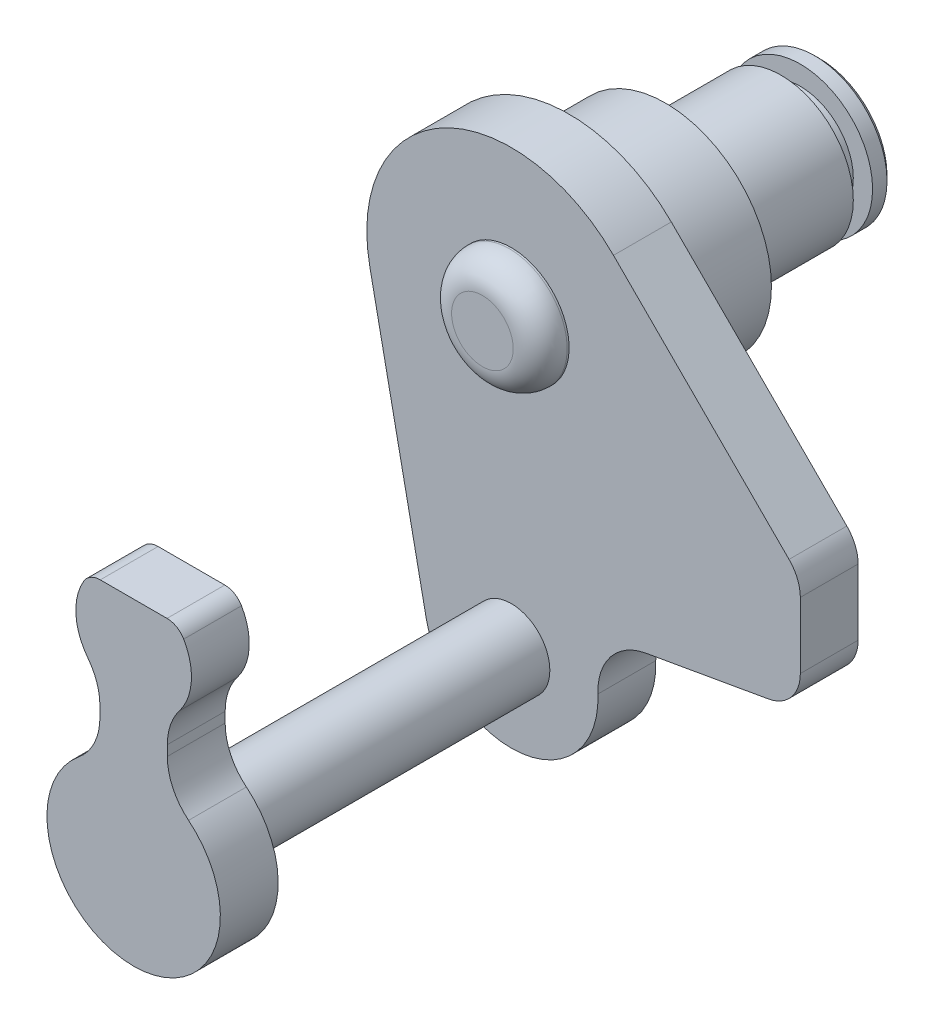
ISO-10303-21;
HEADER;
FILE_DESCRIPTION(('STEP AP214'),'2;1');
FILE_NAME('part.step','',(''),(''),'','','');
FILE_SCHEMA(('AUTOMOTIVE_DESIGN { 1 0 10303 214 1 1 1 1 }'));
ENDSEC;
DATA;
#1=APPLICATION_CONTEXT('core data for automotive mechanical design processes');
#2=APPLICATION_PROTOCOL_DEFINITION('international standard','automotive_design',2000,#1);
#3=PRODUCT_CONTEXT('',#1,'mechanical');
#4=PRODUCT('Part','Part','',(#3));
#5=PRODUCT_RELATED_PRODUCT_CATEGORY('part','',(#4));
#6=PRODUCT_DEFINITION_FORMATION('','',#4);
#7=PRODUCT_DEFINITION_CONTEXT('part definition',#1,'design');
#8=PRODUCT_DEFINITION('design','',#6,#7);
#9=PRODUCT_DEFINITION_SHAPE('','',#8);
#10=(LENGTH_UNIT() NAMED_UNIT(*) SI_UNIT(.MILLI.,.METRE.));
#11=(NAMED_UNIT(*) PLANE_ANGLE_UNIT() SI_UNIT($,.RADIAN.));
#12=(NAMED_UNIT(*) SI_UNIT($,.STERADIAN.) SOLID_ANGLE_UNIT());
#13=UNCERTAINTY_MEASURE_WITH_UNIT(LENGTH_MEASURE(1.E-05),#10,'distance_accuracy_value','');
#14=(GEOMETRIC_REPRESENTATION_CONTEXT(3) GLOBAL_UNCERTAINTY_ASSIGNED_CONTEXT((#13)) GLOBAL_UNIT_ASSIGNED_CONTEXT((#10,
#11,#12)) REPRESENTATION_CONTEXT('',''));
#15=CARTESIAN_POINT('',(0.,0.,0.));
#16=DIRECTION('',(0.,0.,1.));
#17=DIRECTION('',(1.,0.,0.));
#18=AXIS2_PLACEMENT_3D('',#15,#16,#17);
#19=CARTESIAN_POINT('',(0.,0.,-19.6));
#20=DIRECTION('',(0.,0.,-1.));
#21=DIRECTION('',(-1.,0.,0.));
#22=AXIS2_PLACEMENT_3D('',#19,#20,#21);
#23=PLANE('',#22);
#24=DIRECTION('',(0.,-1.,0.));
#25=VECTOR('',#24,1.);
#26=CARTESIAN_POINT('',(15.,4.67575793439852,-19.6));
#27=LINE('',#26,#25);
#28=CARTESIAN_POINT('',(15.,9.77817459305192,-19.6));
#29=VERTEX_POINT('',#28);
#30=CARTESIAN_POINT('',(15.,6.35395719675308,-19.6));
#31=VERTEX_POINT('',#30);
#32=EDGE_CURVE('E263',#29,#31,#27,.T.);
#33=ORIENTED_EDGE('',*,*,#32,.T.);
#34=CARTESIAN_POINT('',(13.,6.35395719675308,-19.6));
#35=DIRECTION('',(0.,0.,-1.));
#36=DIRECTION('',(-1.,0.,0.));
#37=AXIS2_PLACEMENT_3D('',#34,#35,#36);
#38=CIRCLE('',#37,2.);
#39=CARTESIAN_POINT('',(13.3472963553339,4.38434169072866,-19.6));
#40=VERTEX_POINT('',#39);
#41=EDGE_CURVE('E398',#31,#40,#38,.T.);
#42=ORIENTED_EDGE('',*,*,#41,.T.);
#43=DIRECTION('',(-0.984807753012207,-0.173648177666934,0.));
#44=VECTOR('',#43,1.);
#45=CARTESIAN_POINT('',(15.,4.67575793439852,-19.6));
#46=LINE('',#45,#44);
#47=CARTESIAN_POINT('',(6.972813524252,3.26034837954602,-19.6));
#48=VERTEX_POINT('',#47);
#49=EDGE_CURVE('E266',#40,#48,#46,.T.);
#50=ORIENTED_EDGE('',*,*,#49,.T.);
#51=CARTESIAN_POINT('',(7.4937580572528,0.305925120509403,-19.6));
#52=DIRECTION('',(0.,0.,-1.));
#53=DIRECTION('',(-1.,0.,0.));
#54=AXIS2_PLACEMENT_3D('',#51,#52,#53);
#55=CIRCLE('',#54,3.);
#56=CARTESIAN_POINT('',(4.49625483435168,0.183555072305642,-19.6));
#57=VERTEX_POINT('',#56);
#58=EDGE_CURVE('E382',#48,#57,#55,.F.);
#59=ORIENTED_EDGE('',*,*,#58,.T.);
#60=CARTESIAN_POINT('',(0.,0.,-19.6));
#61=DIRECTION('',(0.,0.,-1.));
#62=DIRECTION('',(-1.,0.,0.));
#63=AXIS2_PLACEMENT_3D('',#60,#61,#62);
#64=CIRCLE('',#63,4.5);
#65=CARTESIAN_POINT('',(-4.40908153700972,-0.9,-19.6));
#66=VERTEX_POINT('',#65);
#67=EDGE_CURVE('E255',#57,#66,#64,.T.);
#68=ORIENTED_EDGE('',*,*,#67,.T.);
#69=DIRECTION('',(-0.2,0.979795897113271,0.));
#70=VECTOR('',#69,1.);
#71=CARTESIAN_POINT('',(-7.34846922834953,13.5,-19.6));
#72=LINE('',#71,#70);
#73=CARTESIAN_POINT('',(-7.34846922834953,13.5,-19.6));
#74=VERTEX_POINT('',#73);
#75=EDGE_CURVE('E257',#66,#74,#72,.T.);
#76=ORIENTED_EDGE('',*,*,#75,.T.);
#77=CARTESIAN_POINT('',(0.,15.,-19.6));
#78=DIRECTION('',(0.,0.,-1.));
#79=DIRECTION('',(-1.,0.,0.));
#80=AXIS2_PLACEMENT_3D('',#77,#78,#79);
#81=CIRCLE('',#80,7.5);
#82=CARTESIAN_POINT('',(5.30330085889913,20.3033008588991,-19.6));
#83=VERTEX_POINT('',#82);
#84=EDGE_CURVE('E259',#74,#83,#81,.T.);
#85=ORIENTED_EDGE('',*,*,#84,.T.);
#86=DIRECTION('',(0.707106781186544,-0.707106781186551,0.));
#87=VECTOR('',#86,1.);
#88=CARTESIAN_POINT('',(5.30330085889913,20.3033008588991,-19.6));
#89=LINE('',#88,#87);
#90=CARTESIAN_POINT('',(14.4142135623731,11.192388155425,-19.6));
#91=VERTEX_POINT('',#90);
#92=EDGE_CURVE('E261',#83,#91,#89,.T.);
#93=ORIENTED_EDGE('',*,*,#92,.T.);
#94=CARTESIAN_POINT('',(13.,9.77817459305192,-19.6));
#95=DIRECTION('',(0.,0.,-1.));
#96=DIRECTION('',(-1.,0.,0.));
#97=AXIS2_PLACEMENT_3D('',#94,#95,#96);
#98=CIRCLE('',#97,2.);
#99=EDGE_CURVE('E396',#91,#29,#98,.T.);
#100=ORIENTED_EDGE('',*,*,#99,.T.);
#101=EDGE_LOOP('',(#33,#42,#50,#59,#68,#76,#85,#93,#100));
#102=FACE_BOUND('',#101,.T.);
#103=DIRECTION('',(-1.,0.,0.));
#104=VECTOR('',#103,1.);
#105=CARTESIAN_POINT('',(1.6583123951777,-2.5,-19.6));
#106=LINE('',#105,#104);
#107=CARTESIAN_POINT('',(1.6583123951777,-2.5,-19.6));
#108=VERTEX_POINT('',#107);
#109=CARTESIAN_POINT('',(-1.6583123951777,-2.5,-19.6));
#110=VERTEX_POINT('',#109);
#111=EDGE_CURVE('E205',#108,#110,#106,.T.);
#112=ORIENTED_EDGE('',*,*,#111,.F.);
#113=CARTESIAN_POINT('',(0.,0.,-19.6));
#114=DIRECTION('',(0.,0.,-1.));
#115=DIRECTION('',(-1.,0.,0.));
#116=AXIS2_PLACEMENT_3D('',#113,#114,#115);
#117=CIRCLE('',#116,3.);
#118=CARTESIAN_POINT('',(1.6583123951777,2.5,-19.6));
#119=VERTEX_POINT('',#118);
#120=EDGE_CURVE('E216',#119,#108,#117,.T.);
#121=ORIENTED_EDGE('',*,*,#120,.F.);
#122=DIRECTION('',(1.,0.,0.));
#123=VECTOR('',#122,1.);
#124=CARTESIAN_POINT('',(1.6583123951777,2.5,-19.6));
#125=LINE('',#124,#123);
#126=CARTESIAN_POINT('',(-1.6583123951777,2.5,-19.6));
#127=VERTEX_POINT('',#126);
#128=EDGE_CURVE('E228',#127,#119,#125,.T.);
#129=ORIENTED_EDGE('',*,*,#128,.F.);
#130=CARTESIAN_POINT('',(0.,0.,-19.6));
#131=DIRECTION('',(0.,0.,-1.));
#132=DIRECTION('',(-1.,0.,0.));
#133=AXIS2_PLACEMENT_3D('',#130,#131,#132);
#134=CIRCLE('',#133,3.);
#135=EDGE_CURVE('E226',#110,#127,#134,.T.);
#136=ORIENTED_EDGE('',*,*,#135,.F.);
#137=EDGE_LOOP('',(#112,#121,#129,#136));
#138=FACE_BOUND('',#137,.T.);
#139=CARTESIAN_POINT('',(0.,15.,-19.6));
#140=DIRECTION('',(0.,0.,1.));
#141=DIRECTION('',(1.,0.,0.));
#142=AXIS2_PLACEMENT_3D('',#139,#140,#141);
#143=CIRCLE('',#142,5.5);
#144=CARTESIAN_POINT('',(5.5,15.,-19.6));
#145=VERTEX_POINT('',#144);
#146=EDGE_CURVE('E222',#145,#145,#143,.T.);
#147=ORIENTED_EDGE('',*,*,#146,.T.);
#148=EDGE_LOOP('',(#147));
#149=FACE_BOUND('',#148,.T.);
#150=ADVANCED_FACE('F31',(#102,#138,#149),#23,.T.);
#151=CARTESIAN_POINT('',(0.,0.,-16.6));
#152=DIRECTION('',(0.,0.,-1.));
#153=DIRECTION('',(-1.,0.,0.));
#154=AXIS2_PLACEMENT_3D('',#151,#152,#153);
#155=PLANE('',#154);
#156=CARTESIAN_POINT('',(0.,0.,-16.6));
#157=DIRECTION('',(0.,0.,-1.));
#158=DIRECTION('',(-1.,0.,0.));
#159=AXIS2_PLACEMENT_3D('',#156,#157,#158);
#160=CIRCLE('',#159,2.);
#161=CARTESIAN_POINT('',(2.,0.,-16.6));
#162=VERTEX_POINT('',#161);
#163=EDGE_CURVE('E277',#162,#162,#160,.T.);
#164=ORIENTED_EDGE('',*,*,#163,.T.);
#165=EDGE_LOOP('',(#164));
#166=FACE_BOUND('',#165,.T.);
#167=DIRECTION('',(-0.984807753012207,-0.173648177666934,0.));
#168=VECTOR('',#167,1.);
#169=CARTESIAN_POINT('',(15.,4.67575793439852,-16.6));
#170=LINE('',#169,#168);
#171=CARTESIAN_POINT('',(13.3472963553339,4.38434169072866,-16.6));
#172=VERTEX_POINT('',#171);
#173=CARTESIAN_POINT('',(6.972813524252,3.26034837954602,-16.6));
#174=VERTEX_POINT('',#173);
#175=EDGE_CURVE('E253',#172,#174,#170,.T.);
#176=ORIENTED_EDGE('',*,*,#175,.F.);
#177=CARTESIAN_POINT('',(13.,6.35395719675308,-16.6));
#178=DIRECTION('',(0.,0.,-1.));
#179=DIRECTION('',(-1.,0.,0.));
#180=AXIS2_PLACEMENT_3D('',#177,#178,#179);
#181=CIRCLE('',#180,2.);
#182=CARTESIAN_POINT('',(15.,6.35395719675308,-16.6));
#183=VERTEX_POINT('',#182);
#184=EDGE_CURVE('E389',#172,#183,#181,.F.);
#185=ORIENTED_EDGE('',*,*,#184,.T.);
#186=DIRECTION('',(0.,-1.,0.));
#187=VECTOR('',#186,1.);
#188=CARTESIAN_POINT('',(15.,4.67575793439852,-16.6));
#189=LINE('',#188,#187);
#190=CARTESIAN_POINT('',(15.,9.77817459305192,-16.6));
#191=VERTEX_POINT('',#190);
#192=EDGE_CURVE('E250',#191,#183,#189,.T.);
#193=ORIENTED_EDGE('',*,*,#192,.F.);
#194=CARTESIAN_POINT('',(13.,9.77817459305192,-16.6));
#195=DIRECTION('',(0.,0.,-1.));
#196=DIRECTION('',(-1.,0.,0.));
#197=AXIS2_PLACEMENT_3D('',#194,#195,#196);
#198=CIRCLE('',#197,2.);
#199=CARTESIAN_POINT('',(14.4142135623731,11.192388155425,-16.6));
#200=VERTEX_POINT('',#199);
#201=EDGE_CURVE('E387',#191,#200,#198,.F.);
#202=ORIENTED_EDGE('',*,*,#201,.T.);
#203=DIRECTION('',(0.707106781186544,-0.707106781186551,0.));
#204=VECTOR('',#203,1.);
#205=CARTESIAN_POINT('',(5.30330085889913,20.3033008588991,-16.6));
#206=LINE('',#205,#204);
#207=CARTESIAN_POINT('',(5.30330085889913,20.3033008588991,-16.6));
#208=VERTEX_POINT('',#207);
#209=EDGE_CURVE('E248',#208,#200,#206,.T.);
#210=ORIENTED_EDGE('',*,*,#209,.F.);
#211=CARTESIAN_POINT('',(0.,15.,-16.6));
#212=DIRECTION('',(0.,0.,-1.));
#213=DIRECTION('',(-1.,0.,0.));
#214=AXIS2_PLACEMENT_3D('',#211,#212,#213);
#215=CIRCLE('',#214,7.5);
#216=CARTESIAN_POINT('',(-7.34846922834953,13.5,-16.6));
#217=VERTEX_POINT('',#216);
#218=EDGE_CURVE('E246',#217,#208,#215,.T.);
#219=ORIENTED_EDGE('',*,*,#218,.F.);
#220=DIRECTION('',(-0.2,0.979795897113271,0.));
#221=VECTOR('',#220,1.);
#222=CARTESIAN_POINT('',(-7.34846922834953,13.5,-16.6));
#223=LINE('',#222,#221);
#224=CARTESIAN_POINT('',(-4.40908153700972,-0.9,-16.6));
#225=VERTEX_POINT('',#224);
#226=EDGE_CURVE('E244',#225,#217,#223,.T.);
#227=ORIENTED_EDGE('',*,*,#226,.F.);
#228=CARTESIAN_POINT('',(0.,0.,-16.6));
#229=DIRECTION('',(0.,0.,-1.));
#230=DIRECTION('',(-1.,0.,0.));
#231=AXIS2_PLACEMENT_3D('',#228,#229,#230);
#232=CIRCLE('',#231,4.5);
#233=CARTESIAN_POINT('',(4.49625483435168,0.183555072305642,-16.6));
#234=VERTEX_POINT('',#233);
#235=EDGE_CURVE('E211',#234,#225,#232,.T.);
#236=ORIENTED_EDGE('',*,*,#235,.F.);
#237=CARTESIAN_POINT('',(7.4937580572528,0.305925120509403,-16.6));
#238=DIRECTION('',(0.,0.,-1.));
#239=DIRECTION('',(-1.,0.,0.));
#240=AXIS2_PLACEMENT_3D('',#237,#238,#239);
#241=CIRCLE('',#240,3.);
#242=EDGE_CURVE('E379',#234,#174,#241,.T.);
#243=ORIENTED_EDGE('',*,*,#242,.T.);
#244=EDGE_LOOP('',(#176,#185,#193,#202,#210,#219,#227,#236,#243));
#245=FACE_BOUND('',#244,.T.);
#246=CARTESIAN_POINT('',(0.,15.,-16.6));
#247=DIRECTION('',(0.,0.,-1.));
#248=DIRECTION('',(-1.,0.,0.));
#249=AXIS2_PLACEMENT_3D('',#246,#247,#248);
#250=CIRCLE('',#249,3.);
#251=CARTESIAN_POINT('',(-3.,15.,-16.6));
#252=VERTEX_POINT('',#251);
#253=EDGE_CURVE('E401',#252,#252,#250,.F.);
#254=ORIENTED_EDGE('',*,*,#253,.F.);
#255=EDGE_LOOP('',(#254));
#256=FACE_BOUND('',#255,.T.);
#257=ADVANCED_FACE('F428',(#166,#245,#256),#155,.F.);
#258=CARTESIAN_POINT('',(0.,10.,0.));
#259=DIRECTION('',(0.,0.,1.));
#260=DIRECTION('',(1.,0.,0.));
#261=AXIS2_PLACEMENT_3D('',#258,#259,#260);
#262=PLANE('',#261);
#263=CARTESIAN_POINT('',(0.,10.,0.));
#264=DIRECTION('',(0.,0.,1.));
#265=DIRECTION('',(1.,0.,0.));
#266=AXIS2_PLACEMENT_3D('',#263,#264,#265);
#267=CIRCLE('',#266,3.);
#268=CARTESIAN_POINT('',(-2.59807621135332,11.5,0.));
#269=VERTEX_POINT('',#268);
#270=CARTESIAN_POINT('',(-2.375,8.1671402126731,0.));
#271=VERTEX_POINT('',#270);
#272=EDGE_CURVE('E285',#269,#271,#267,.T.);
#273=ORIENTED_EDGE('',*,*,#272,.F.);
#274=CARTESIAN_POINT('',(-1.73205080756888,11.,0.));
#275=DIRECTION('',(0.,0.,1.));
#276=DIRECTION('',(1.,0.,0.));
#277=AXIS2_PLACEMENT_3D('',#274,#275,#276);
#278=CIRCLE('',#277,1.);
#279=CARTESIAN_POINT('',(-1.73205080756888,12.,0.));
#280=VERTEX_POINT('',#279);
#281=EDGE_CURVE('E320',#269,#280,#278,.F.);
#282=ORIENTED_EDGE('',*,*,#281,.T.);
#283=DIRECTION('',(-1.,0.,0.));
#284=VECTOR('',#283,1.);
#285=CARTESIAN_POINT('',(-2.23606797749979,12.,0.));
#286=LINE('',#285,#284);
#287=CARTESIAN_POINT('',(1.73205080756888,12.,0.));
#288=VERTEX_POINT('',#287);
#289=EDGE_CURVE('E282',#288,#280,#286,.T.);
#290=ORIENTED_EDGE('',*,*,#289,.F.);
#291=CARTESIAN_POINT('',(1.73205080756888,11.,0.));
#292=DIRECTION('',(0.,0.,1.));
#293=DIRECTION('',(1.,0.,0.));
#294=AXIS2_PLACEMENT_3D('',#291,#292,#293);
#295=CIRCLE('',#294,1.);
#296=CARTESIAN_POINT('',(2.59807621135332,11.5,0.));
#297=VERTEX_POINT('',#296);
#298=EDGE_CURVE('E317',#288,#297,#295,.F.);
#299=ORIENTED_EDGE('',*,*,#298,.T.);
#300=CARTESIAN_POINT('',(0.,10.,0.));
#301=DIRECTION('',(0.,0.,1.));
#302=DIRECTION('',(1.,0.,0.));
#303=AXIS2_PLACEMENT_3D('',#300,#301,#302);
#304=CIRCLE('',#303,3.);
#305=CARTESIAN_POINT('',(2.375,8.1671402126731,0.));
#306=VERTEX_POINT('',#305);
#307=EDGE_CURVE('E280',#306,#297,#304,.T.);
#308=ORIENTED_EDGE('',*,*,#307,.F.);
#309=CARTESIAN_POINT('',(4.75,6.33428042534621,0.));
#310=DIRECTION('',(0.,0.,1.));
#311=DIRECTION('',(1.,0.,0.));
#312=AXIS2_PLACEMENT_3D('',#309,#310,#311);
#313=CIRCLE('',#312,3.);
#314=CARTESIAN_POINT('',(1.75,6.33428042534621,0.));
#315=VERTEX_POINT('',#314);
#316=EDGE_CURVE('E354',#306,#315,#313,.T.);
#317=ORIENTED_EDGE('',*,*,#316,.T.);
#318=DIRECTION('',(0.,1.,0.));
#319=VECTOR('',#318,1.);
#320=CARTESIAN_POINT('',(1.75,4.14578098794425,0.));
#321=LINE('',#320,#319);
#322=CARTESIAN_POINT('',(1.75,5.80409338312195,0.));
#323=VERTEX_POINT('',#322);
#324=EDGE_CURVE('E294',#323,#315,#321,.T.);
#325=ORIENTED_EDGE('',*,*,#324,.F.);
#326=CARTESIAN_POINT('',(4.75,5.80409338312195,0.));
#327=DIRECTION('',(0.,0.,1.));
#328=DIRECTION('',(1.,0.,0.));
#329=AXIS2_PLACEMENT_3D('',#326,#327,#328);
#330=CIRCLE('',#329,3.);
#331=CARTESIAN_POINT('',(2.85,3.48245602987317,0.));
#332=VERTEX_POINT('',#331);
#333=EDGE_CURVE('E358',#323,#332,#330,.T.);
#334=ORIENTED_EDGE('',*,*,#333,.T.);
#335=CARTESIAN_POINT('',(0.,0.,0.));
#336=DIRECTION('',(0.,0.,1.));
#337=DIRECTION('',(1.,0.,0.));
#338=AXIS2_PLACEMENT_3D('',#335,#336,#337);
#339=CIRCLE('',#338,4.5);
#340=CARTESIAN_POINT('',(-2.85,3.48245602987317,0.));
#341=VERTEX_POINT('',#340);
#342=EDGE_CURVE('E291',#341,#332,#339,.T.);
#343=ORIENTED_EDGE('',*,*,#342,.F.);
#344=CARTESIAN_POINT('',(-4.75,5.80409338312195,0.));
#345=DIRECTION('',(0.,0.,1.));
#346=DIRECTION('',(1.,0.,0.));
#347=AXIS2_PLACEMENT_3D('',#344,#345,#346);
#348=CIRCLE('',#347,3.);
#349=CARTESIAN_POINT('',(-1.75,5.80409338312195,0.));
#350=VERTEX_POINT('',#349);
#351=EDGE_CURVE('E362',#341,#350,#348,.T.);
#352=ORIENTED_EDGE('',*,*,#351,.T.);
#353=DIRECTION('',(0.,-1.,0.));
#354=VECTOR('',#353,1.);
#355=CARTESIAN_POINT('',(-1.75,4.14578098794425,0.));
#356=LINE('',#355,#354);
#357=CARTESIAN_POINT('',(-1.75,6.33428042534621,0.));
#358=VERTEX_POINT('',#357);
#359=EDGE_CURVE('E288',#358,#350,#356,.T.);
#360=ORIENTED_EDGE('',*,*,#359,.F.);
#361=CARTESIAN_POINT('',(-4.75,6.3342804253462,0.));
#362=DIRECTION('',(0.,0.,1.));
#363=DIRECTION('',(1.,0.,0.));
#364=AXIS2_PLACEMENT_3D('',#361,#362,#363);
#365=CIRCLE('',#364,3.);
#366=EDGE_CURVE('E366',#358,#271,#365,.T.);
#367=ORIENTED_EDGE('',*,*,#366,.T.);
#368=EDGE_LOOP('',(#273,#282,#290,#299,#308,#317,#325,#334,#343,#352,#360,#367));
#369=FACE_BOUND('',#368,.T.);
#370=CARTESIAN_POINT('',(0.,0.,0.));
#371=DIRECTION('',(0.,0.,1.));
#372=DIRECTION('',(1.,0.,0.));
#373=AXIS2_PLACEMENT_3D('',#370,#371,#372);
#374=CIRCLE('',#373,2.);
#375=CARTESIAN_POINT('',(2.,0.,0.));
#376=VERTEX_POINT('',#375);
#377=EDGE_CURVE('E370',#376,#376,#374,.F.);
#378=ORIENTED_EDGE('',*,*,#377,.F.);
#379=EDGE_LOOP('',(#378));
#380=FACE_BOUND('',#379,.T.);
#381=ADVANCED_FACE('F434',(#369,#380),#262,.F.);
#382=CARTESIAN_POINT('',(0.,10.,3.));
#383=DIRECTION('',(0.,0.,-1.));
#384=DIRECTION('',(-1.,0.,0.));
#385=AXIS2_PLACEMENT_3D('',#382,#383,#384);
#386=CYLINDRICAL_SURFACE('',#385,3.);
#387=CARTESIAN_POINT('',(0.,10.,3.));
#388=DIRECTION('',(0.,0.,1.));
#389=DIRECTION('',(1.,0.,0.));
#390=AXIS2_PLACEMENT_3D('',#387,#388,#389);
#391=CIRCLE('',#390,3.);
#392=CARTESIAN_POINT('',(2.375,8.1671402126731,3.));
#393=VERTEX_POINT('',#392);
#394=CARTESIAN_POINT('',(2.59807621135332,11.5,3.));
#395=VERTEX_POINT('',#394);
#396=EDGE_CURVE('E297',#393,#395,#391,.T.);
#397=ORIENTED_EDGE('',*,*,#396,.F.);
#398=DIRECTION('',(0.,0.,-1.));
#399=VECTOR('',#398,1.);
#400=CARTESIAN_POINT('',(2.375,8.1671402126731,3.));
#401=LINE('',#400,#399);
#402=EDGE_CURVE('E334',#393,#306,#401,.T.);
#403=ORIENTED_EDGE('',*,*,#402,.T.);
#404=ORIENTED_EDGE('',*,*,#307,.T.);
#405=DIRECTION('',(0.,0.,-1.));
#406=VECTOR('',#405,1.);
#407=CARTESIAN_POINT('',(2.59807621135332,11.5,3.));
#408=LINE('',#407,#406);
#409=EDGE_CURVE('E331',#297,#395,#408,.F.);
#410=ORIENTED_EDGE('',*,*,#409,.T.);
#411=EDGE_LOOP('',(#397,#403,#404,#410));
#412=FACE_BOUND('',#411,.T.);
#413=ADVANCED_FACE('F33',(#412),#386,.T.);
#414=CARTESIAN_POINT('',(-2.23606797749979,12.,3.));
#415=DIRECTION('',(0.,-1.,0.));
#416=DIRECTION('',(0.,0.,-1.));
#417=AXIS2_PLACEMENT_3D('',#414,#415,#416);
#418=PLANE('',#417);
#419=ORIENTED_EDGE('',*,*,#289,.T.);
#420=DIRECTION('',(0.,0.,-1.));
#421=VECTOR('',#420,1.);
#422=CARTESIAN_POINT('',(-1.73205080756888,12.,3.));
#423=LINE('',#422,#421);
#424=CARTESIAN_POINT('',(-1.73205080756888,12.,3.));
#425=VERTEX_POINT('',#424);
#426=EDGE_CURVE('E325',#280,#425,#423,.F.);
#427=ORIENTED_EDGE('',*,*,#426,.T.);
#428=DIRECTION('',(-1.,0.,0.));
#429=VECTOR('',#428,1.);
#430=CARTESIAN_POINT('',(-2.23606797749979,12.,3.));
#431=LINE('',#430,#429);
#432=CARTESIAN_POINT('',(1.73205080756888,12.,3.));
#433=VERTEX_POINT('',#432);
#434=EDGE_CURVE('E299',#433,#425,#431,.T.);
#435=ORIENTED_EDGE('',*,*,#434,.F.);
#436=DIRECTION('',(0.,0.,-1.));
#437=VECTOR('',#436,1.);
#438=CARTESIAN_POINT('',(1.73205080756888,12.,3.));
#439=LINE('',#438,#437);
#440=EDGE_CURVE('E322',#433,#288,#439,.T.);
#441=ORIENTED_EDGE('',*,*,#440,.T.);
#442=EDGE_LOOP('',(#419,#427,#435,#441));
#443=FACE_BOUND('',#442,.T.);
#444=ADVANCED_FACE('F512',(#443),#418,.F.);
#445=CARTESIAN_POINT('',(0.,10.,3.));
#446=DIRECTION('',(0.,0.,-1.));
#447=DIRECTION('',(-1.,0.,0.));
#448=AXIS2_PLACEMENT_3D('',#445,#446,#447);
#449=CYLINDRICAL_SURFACE('',#448,3.);
#450=ORIENTED_EDGE('',*,*,#272,.T.);
#451=DIRECTION('',(0.,0.,-1.));
#452=VECTOR('',#451,1.);
#453=CARTESIAN_POINT('',(-2.375,8.1671402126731,3.));
#454=LINE('',#453,#452);
#455=CARTESIAN_POINT('',(-2.375,8.1671402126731,3.));
#456=VERTEX_POINT('',#455);
#457=EDGE_CURVE('E352',#271,#456,#454,.F.);
#458=ORIENTED_EDGE('',*,*,#457,.T.);
#459=CARTESIAN_POINT('',(0.,10.,3.));
#460=DIRECTION('',(0.,0.,1.));
#461=DIRECTION('',(1.,0.,0.));
#462=AXIS2_PLACEMENT_3D('',#459,#460,#461);
#463=CIRCLE('',#462,3.);
#464=CARTESIAN_POINT('',(-2.59807621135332,11.5,3.));
#465=VERTEX_POINT('',#464);
#466=EDGE_CURVE('E302',#465,#456,#463,.T.);
#467=ORIENTED_EDGE('',*,*,#466,.F.);
#468=DIRECTION('',(0.,0.,-1.));
#469=VECTOR('',#468,1.);
#470=CARTESIAN_POINT('',(-2.59807621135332,11.5,3.));
#471=LINE('',#470,#469);
#472=EDGE_CURVE('E314',#465,#269,#471,.T.);
#473=ORIENTED_EDGE('',*,*,#472,.T.);
#474=EDGE_LOOP('',(#450,#458,#467,#473));
#475=FACE_BOUND('',#474,.T.);
#476=ADVANCED_FACE('F509',(#475),#449,.T.);
#477=CARTESIAN_POINT('',(-1.75,4.14578098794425,3.));
#478=DIRECTION('',(1.,0.,0.));
#479=DIRECTION('',(0.,1.,0.));
#480=AXIS2_PLACEMENT_3D('',#477,#478,#479);
#481=PLANE('',#480);
#482=ORIENTED_EDGE('',*,*,#359,.T.);
#483=DIRECTION('',(0.,0.,1.));
#484=VECTOR('',#483,1.);
#485=CARTESIAN_POINT('',(-1.75,5.80409338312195,3.));
#486=LINE('',#485,#484);
#487=CARTESIAN_POINT('',(-1.75,5.80409338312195,3.));
#488=VERTEX_POINT('',#487);
#489=EDGE_CURVE('E350',#350,#488,#486,.T.);
#490=ORIENTED_EDGE('',*,*,#489,.T.);
#491=DIRECTION('',(0.,-1.,0.));
#492=VECTOR('',#491,1.);
#493=CARTESIAN_POINT('',(-1.75,4.14578098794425,3.));
#494=LINE('',#493,#492);
#495=CARTESIAN_POINT('',(-1.75,6.33428042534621,3.));
#496=VERTEX_POINT('',#495);
#497=EDGE_CURVE('E305',#496,#488,#494,.T.);
#498=ORIENTED_EDGE('',*,*,#497,.F.);
#499=DIRECTION('',(0.,0.,1.));
#500=VECTOR('',#499,1.);
#501=CARTESIAN_POINT('',(-1.75,6.33428042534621,0.));
#502=LINE('',#501,#500);
#503=EDGE_CURVE('E347',#496,#358,#502,.F.);
#504=ORIENTED_EDGE('',*,*,#503,.T.);
#505=EDGE_LOOP('',(#482,#490,#498,#504));
#506=FACE_BOUND('',#505,.T.);
#507=ADVANCED_FACE('F505',(#506),#481,.F.);
#508=CARTESIAN_POINT('',(0.,0.,3.));
#509=DIRECTION('',(0.,0.,-1.));
#510=DIRECTION('',(-1.,0.,0.));
#511=AXIS2_PLACEMENT_3D('',#508,#509,#510);
#512=CYLINDRICAL_SURFACE('',#511,4.5);
#513=ORIENTED_EDGE('',*,*,#342,.T.);
#514=DIRECTION('',(0.,0.,-1.));
#515=VECTOR('',#514,1.);
#516=CARTESIAN_POINT('',(2.85,3.48245602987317,3.));
#517=LINE('',#516,#515);
#518=CARTESIAN_POINT('',(2.85,3.48245602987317,3.));
#519=VERTEX_POINT('',#518);
#520=EDGE_CURVE('E345',#332,#519,#517,.F.);
#521=ORIENTED_EDGE('',*,*,#520,.T.);
#522=CARTESIAN_POINT('',(0.,0.,3.));
#523=DIRECTION('',(0.,0.,1.));
#524=DIRECTION('',(1.,0.,0.));
#525=AXIS2_PLACEMENT_3D('',#522,#523,#524);
#526=CIRCLE('',#525,4.5);
#527=CARTESIAN_POINT('',(-2.85,3.48245602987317,3.));
#528=VERTEX_POINT('',#527);
#529=EDGE_CURVE('E308',#528,#519,#526,.T.);
#530=ORIENTED_EDGE('',*,*,#529,.F.);
#531=DIRECTION('',(0.,0.,-1.));
#532=VECTOR('',#531,1.);
#533=CARTESIAN_POINT('',(-2.85,3.48245602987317,3.));
#534=LINE('',#533,#532);
#535=EDGE_CURVE('E342',#528,#341,#534,.T.);
#536=ORIENTED_EDGE('',*,*,#535,.T.);
#537=EDGE_LOOP('',(#513,#521,#530,#536));
#538=FACE_BOUND('',#537,.T.);
#539=ADVANCED_FACE('F501',(#538),#512,.T.);
#540=CARTESIAN_POINT('',(1.75,4.14578098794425,3.));
#541=DIRECTION('',(-1.,0.,0.));
#542=DIRECTION('',(0.,0.,1.));
#543=AXIS2_PLACEMENT_3D('',#540,#541,#542);
#544=PLANE('',#543);
#545=ORIENTED_EDGE('',*,*,#324,.T.);
#546=DIRECTION('',(0.,0.,1.));
#547=VECTOR('',#546,1.);
#548=CARTESIAN_POINT('',(1.75,6.33428042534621,3.));
#549=LINE('',#548,#547);
#550=CARTESIAN_POINT('',(1.75,6.33428042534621,3.));
#551=VERTEX_POINT('',#550);
#552=EDGE_CURVE('E340',#315,#551,#549,.T.);
#553=ORIENTED_EDGE('',*,*,#552,.T.);
#554=DIRECTION('',(0.,1.,0.));
#555=VECTOR('',#554,1.);
#556=CARTESIAN_POINT('',(1.75,4.14578098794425,3.));
#557=LINE('',#556,#555);
#558=CARTESIAN_POINT('',(1.75,5.80409338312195,3.));
#559=VERTEX_POINT('',#558);
#560=EDGE_CURVE('E311',#559,#551,#557,.T.);
#561=ORIENTED_EDGE('',*,*,#560,.F.);
#562=DIRECTION('',(0.,0.,1.));
#563=VECTOR('',#562,1.);
#564=CARTESIAN_POINT('',(1.75,5.80409338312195,0.));
#565=LINE('',#564,#563);
#566=EDGE_CURVE('E337',#559,#323,#565,.F.);
#567=ORIENTED_EDGE('',*,*,#566,.T.);
#568=EDGE_LOOP('',(#545,#553,#561,#567));
#569=FACE_BOUND('',#568,.T.);
#570=ADVANCED_FACE('F497',(#569),#544,.F.);
#571=CARTESIAN_POINT('',(0.,10.,3.));
#572=DIRECTION('',(0.,0.,1.));
#573=DIRECTION('',(1.,0.,0.));
#574=AXIS2_PLACEMENT_3D('',#571,#572,#573);
#575=PLANE('',#574);
#576=ORIENTED_EDGE('',*,*,#434,.T.);
#577=CARTESIAN_POINT('',(-1.73205080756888,11.,3.));
#578=DIRECTION('',(0.,0.,1.));
#579=DIRECTION('',(1.,0.,0.));
#580=AXIS2_PLACEMENT_3D('',#577,#578,#579);
#581=CIRCLE('',#580,1.);
#582=EDGE_CURVE('E329',#425,#465,#581,.T.);
#583=ORIENTED_EDGE('',*,*,#582,.T.);
#584=ORIENTED_EDGE('',*,*,#466,.T.);
#585=CARTESIAN_POINT('',(-4.75,6.3342804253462,3.));
#586=DIRECTION('',(0.,0.,1.));
#587=DIRECTION('',(1.,0.,0.));
#588=AXIS2_PLACEMENT_3D('',#585,#586,#587);
#589=CIRCLE('',#588,3.);
#590=EDGE_CURVE('E368',#456,#496,#589,.F.);
#591=ORIENTED_EDGE('',*,*,#590,.T.);
#592=ORIENTED_EDGE('',*,*,#497,.T.);
#593=CARTESIAN_POINT('',(-4.75,5.80409338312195,3.));
#594=DIRECTION('',(0.,0.,1.));
#595=DIRECTION('',(1.,0.,0.));
#596=AXIS2_PLACEMENT_3D('',#593,#594,#595);
#597=CIRCLE('',#596,3.);
#598=EDGE_CURVE('E364',#488,#528,#597,.F.);
#599=ORIENTED_EDGE('',*,*,#598,.T.);
#600=ORIENTED_EDGE('',*,*,#529,.T.);
#601=CARTESIAN_POINT('',(4.75,5.80409338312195,3.));
#602=DIRECTION('',(0.,0.,1.));
#603=DIRECTION('',(1.,0.,0.));
#604=AXIS2_PLACEMENT_3D('',#601,#602,#603);
#605=CIRCLE('',#604,3.);
#606=EDGE_CURVE('E360',#519,#559,#605,.F.);
#607=ORIENTED_EDGE('',*,*,#606,.T.);
#608=ORIENTED_EDGE('',*,*,#560,.T.);
#609=CARTESIAN_POINT('',(4.75,6.33428042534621,3.));
#610=DIRECTION('',(0.,0.,1.));
#611=DIRECTION('',(1.,0.,0.));
#612=AXIS2_PLACEMENT_3D('',#609,#610,#611);
#613=CIRCLE('',#612,3.);
#614=EDGE_CURVE('E356',#551,#393,#613,.F.);
#615=ORIENTED_EDGE('',*,*,#614,.T.);
#616=ORIENTED_EDGE('',*,*,#396,.T.);
#617=CARTESIAN_POINT('',(1.73205080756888,11.,3.));
#618=DIRECTION('',(0.,0.,1.));
#619=DIRECTION('',(1.,0.,0.));
#620=AXIS2_PLACEMENT_3D('',#617,#618,#619);
#621=CIRCLE('',#620,1.);
#622=EDGE_CURVE('E327',#395,#433,#621,.T.);
#623=ORIENTED_EDGE('',*,*,#622,.T.);
#624=EDGE_LOOP('',(#576,#583,#584,#591,#592,#599,#600,#607,#608,#615,#616,#623));
#625=FACE_BOUND('',#624,.T.);
#626=ADVANCED_FACE('F490',(#625),#575,.T.);
#627=CARTESIAN_POINT('',(-1.73205080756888,11.,3.));
#628=DIRECTION('',(0.,0.,-1.));
#629=DIRECTION('',(-1.,0.,0.));
#630=AXIS2_PLACEMENT_3D('',#627,#628,#629);
#631=CYLINDRICAL_SURFACE('',#630,1.);
#632=ORIENTED_EDGE('',*,*,#582,.F.);
#633=ORIENTED_EDGE('',*,*,#426,.F.);
#634=ORIENTED_EDGE('',*,*,#281,.F.);
#635=ORIENTED_EDGE('',*,*,#472,.F.);
#636=EDGE_LOOP('',(#632,#633,#634,#635));
#637=FACE_BOUND('',#636,.T.);
#638=ADVANCED_FACE('F486',(#637),#631,.T.);
#639=CARTESIAN_POINT('',(1.73205080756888,11.,3.));
#640=DIRECTION('',(0.,0.,-1.));
#641=DIRECTION('',(-1.,0.,0.));
#642=AXIS2_PLACEMENT_3D('',#639,#640,#641);
#643=CYLINDRICAL_SURFACE('',#642,1.);
#644=ORIENTED_EDGE('',*,*,#622,.F.);
#645=ORIENTED_EDGE('',*,*,#409,.F.);
#646=ORIENTED_EDGE('',*,*,#298,.F.);
#647=ORIENTED_EDGE('',*,*,#440,.F.);
#648=EDGE_LOOP('',(#644,#645,#646,#647));
#649=FACE_BOUND('',#648,.T.);
#650=ADVANCED_FACE('F482',(#649),#643,.T.);
#651=CARTESIAN_POINT('',(4.75,6.33428042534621,3.));
#652=DIRECTION('',(0.,0.,-1.));
#653=DIRECTION('',(-1.,0.,0.));
#654=AXIS2_PLACEMENT_3D('',#651,#652,#653);
#655=CYLINDRICAL_SURFACE('',#654,3.);
#656=ORIENTED_EDGE('',*,*,#614,.F.);
#657=ORIENTED_EDGE('',*,*,#552,.F.);
#658=ORIENTED_EDGE('',*,*,#316,.F.);
#659=ORIENTED_EDGE('',*,*,#402,.F.);
#660=EDGE_LOOP('',(#656,#657,#658,#659));
#661=FACE_BOUND('',#660,.T.);
#662=ADVANCED_FACE('F478',(#661),#655,.F.);
#663=CARTESIAN_POINT('',(4.75,5.80409338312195,3.));
#664=DIRECTION('',(0.,0.,-1.));
#665=DIRECTION('',(-1.,0.,0.));
#666=AXIS2_PLACEMENT_3D('',#663,#664,#665);
#667=CYLINDRICAL_SURFACE('',#666,3.);
#668=ORIENTED_EDGE('',*,*,#606,.F.);
#669=ORIENTED_EDGE('',*,*,#520,.F.);
#670=ORIENTED_EDGE('',*,*,#333,.F.);
#671=ORIENTED_EDGE('',*,*,#566,.F.);
#672=EDGE_LOOP('',(#668,#669,#670,#671));
#673=FACE_BOUND('',#672,.T.);
#674=ADVANCED_FACE('F474',(#673),#667,.F.);
#675=CARTESIAN_POINT('',(-4.75,5.80409338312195,3.));
#676=DIRECTION('',(0.,0.,-1.));
#677=DIRECTION('',(-1.,0.,0.));
#678=AXIS2_PLACEMENT_3D('',#675,#676,#677);
#679=CYLINDRICAL_SURFACE('',#678,3.);
#680=ORIENTED_EDGE('',*,*,#598,.F.);
#681=ORIENTED_EDGE('',*,*,#489,.F.);
#682=ORIENTED_EDGE('',*,*,#351,.F.);
#683=ORIENTED_EDGE('',*,*,#535,.F.);
#684=EDGE_LOOP('',(#680,#681,#682,#683));
#685=FACE_BOUND('',#684,.T.);
#686=ADVANCED_FACE('F470',(#685),#679,.F.);
#687=CARTESIAN_POINT('',(-4.75,6.3342804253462,3.));
#688=DIRECTION('',(0.,0.,-1.));
#689=DIRECTION('',(-1.,0.,0.));
#690=AXIS2_PLACEMENT_3D('',#687,#688,#689);
#691=CYLINDRICAL_SURFACE('',#690,3.);
#692=ORIENTED_EDGE('',*,*,#590,.F.);
#693=ORIENTED_EDGE('',*,*,#457,.F.);
#694=ORIENTED_EDGE('',*,*,#366,.F.);
#695=ORIENTED_EDGE('',*,*,#503,.F.);
#696=EDGE_LOOP('',(#692,#693,#694,#695));
#697=FACE_BOUND('',#696,.T.);
#698=ADVANCED_FACE('F466',(#697),#691,.F.);
#699=CARTESIAN_POINT('',(0.,0.,-16.6));
#700=DIRECTION('',(0.,0.,1.));
#701=DIRECTION('',(1.,0.,0.));
#702=AXIS2_PLACEMENT_3D('',#699,#700,#701);
#703=CYLINDRICAL_SURFACE('',#702,2.);
#704=CARTESIAN_POINT('',(2.,0.,-16.6));
#705=CARTESIAN_POINT('',(2.,0.,-16.4270833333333));
#706=CARTESIAN_POINT('',(2.,0.,-16.2541666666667));
#707=CARTESIAN_POINT('',(2.,0.,-15.9083333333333));
#708=CARTESIAN_POINT('',(2.,0.,-15.7354166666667));
#709=CARTESIAN_POINT('',(2.,0.,-15.3895833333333));
#710=CARTESIAN_POINT('',(2.,0.,-15.2166666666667));
#711=CARTESIAN_POINT('',(2.,0.,-14.8708333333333));
#712=CARTESIAN_POINT('',(2.,0.,-14.6979166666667));
#713=CARTESIAN_POINT('',(2.,0.,-14.3520833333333));
#714=CARTESIAN_POINT('',(2.,0.,-14.1791666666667));
#715=CARTESIAN_POINT('',(2.,0.,-13.8333333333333));
#716=CARTESIAN_POINT('',(2.,0.,-13.6604166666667));
#717=CARTESIAN_POINT('',(2.,0.,-13.3145833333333));
#718=CARTESIAN_POINT('',(2.,0.,-13.1416666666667));
#719=CARTESIAN_POINT('',(2.,0.,-12.7958333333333));
#720=CARTESIAN_POINT('',(2.,0.,-12.6229166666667));
#721=CARTESIAN_POINT('',(2.,0.,-12.2770833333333));
#722=CARTESIAN_POINT('',(2.,0.,-12.1041666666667));
#723=CARTESIAN_POINT('',(2.,0.,-11.7583333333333));
#724=CARTESIAN_POINT('',(2.,0.,-11.5854166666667));
#725=CARTESIAN_POINT('',(2.,0.,-11.2395833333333));
#726=CARTESIAN_POINT('',(2.,0.,-11.0666666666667));
#727=CARTESIAN_POINT('',(2.,0.,-10.7208333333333));
#728=CARTESIAN_POINT('',(2.,0.,-10.5479166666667));
#729=CARTESIAN_POINT('',(2.,0.,-10.2020833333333));
#730=CARTESIAN_POINT('',(2.,0.,-10.0291666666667));
#731=CARTESIAN_POINT('',(2.,0.,-9.68333333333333));
#732=CARTESIAN_POINT('',(2.,0.,-9.51041666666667));
#733=CARTESIAN_POINT('',(2.,0.,-9.16458333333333));
#734=CARTESIAN_POINT('',(2.,0.,-8.99166666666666));
#735=CARTESIAN_POINT('',(2.,0.,-8.64583333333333));
#736=CARTESIAN_POINT('',(2.,0.,-8.47291666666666));
#737=CARTESIAN_POINT('',(2.,0.,-8.12708333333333));
#738=CARTESIAN_POINT('',(2.,0.,-7.95416666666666));
#739=CARTESIAN_POINT('',(2.,0.,-7.60833333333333));
#740=CARTESIAN_POINT('',(2.,0.,-7.43541666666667));
#741=CARTESIAN_POINT('',(2.,0.,-7.08958333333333));
#742=CARTESIAN_POINT('',(2.,0.,-6.91666666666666));
#743=CARTESIAN_POINT('',(2.,0.,-6.57083333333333));
#744=CARTESIAN_POINT('',(2.,0.,-6.39791666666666));
#745=CARTESIAN_POINT('',(2.,0.,-6.05208333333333));
#746=CARTESIAN_POINT('',(2.,0.,-5.87916666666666));
#747=CARTESIAN_POINT('',(2.,0.,-5.53333333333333));
#748=CARTESIAN_POINT('',(2.,0.,-5.36041666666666));
#749=CARTESIAN_POINT('',(2.,0.,-5.01458333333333));
#750=CARTESIAN_POINT('',(2.,0.,-4.84166666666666));
#751=CARTESIAN_POINT('',(2.,0.,-4.49583333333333));
#752=CARTESIAN_POINT('',(2.,0.,-4.32291666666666));
#753=CARTESIAN_POINT('',(2.,0.,-3.97708333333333));
#754=CARTESIAN_POINT('',(2.,0.,-3.80416666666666));
#755=CARTESIAN_POINT('',(2.,0.,-3.45833333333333));
#756=CARTESIAN_POINT('',(2.,0.,-3.28541666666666));
#757=CARTESIAN_POINT('',(2.,0.,-2.93958333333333));
#758=CARTESIAN_POINT('',(2.,0.,-2.76666666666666));
#759=CARTESIAN_POINT('',(2.,0.,-2.42083333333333));
#760=CARTESIAN_POINT('',(2.,0.,-2.24791666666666));
#761=CARTESIAN_POINT('',(2.,0.,-1.90208333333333));
#762=CARTESIAN_POINT('',(2.,0.,-1.72916666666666));
#763=CARTESIAN_POINT('',(2.,0.,-1.38333333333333));
#764=CARTESIAN_POINT('',(2.,0.,-1.21041666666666));
#765=CARTESIAN_POINT('',(2.,0.,-0.864583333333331));
#766=CARTESIAN_POINT('',(2.,0.,-0.691666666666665));
#767=CARTESIAN_POINT('',(2.,0.,-0.345833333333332));
#768=CARTESIAN_POINT('',(2.,0.,-0.172916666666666));
#769=CARTESIAN_POINT('',(2.,0.,0.));
#770=B_SPLINE_CURVE_WITH_KNOTS('',3,(#704,#705,#706,#707,#708,#709,#710,#711,#712,#713,#714,
#715,#716,#717,#718,#719,#720,#721,#722,#723,#724,#725,#726,#727,#728,#729,#730,#731,#732,#733,
#734,#735,#736,#737,#738,#739,#740,#741,#742,#743,#744,#745,#746,#747,#748,#749,#750,#751,#752,
#753,#754,#755,#756,#757,#758,#759,#760,#761,#762,#763,#764,#765,#766,#767,#768,#769),
.UNSPECIFIED.,.F.,.F.,(4,2,2,2,2,2,2,2,2,2,2,2,2,2,2,2,2,2,2,2,2,2,2,2,2,2,2,2,2,2,2,2,4),(0.,
0.518750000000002,1.0375,1.55625,2.075,2.59375,3.1125,3.63125,4.15,4.66875,5.1875,5.70625,6.225,
6.74375,7.2625,7.78125,8.3,8.81875,9.3375,9.85625,10.375,10.89375,11.4125,11.93125,12.45,
12.96875,13.4875,14.00625,14.525,15.04375,15.5625,16.08125,16.6),.UNSPECIFIED.);
#771=EDGE_CURVE('BSEAM462',#162,#376,#770,.T.);
#772=ORIENTED_EDGE('',*,*,#163,.F.);
#773=ORIENTED_EDGE('',*,*,#377,.T.);
#774=ORIENTED_EDGE('',*,*,#771,.T.);
#775=ORIENTED_EDGE('',*,*,#771,.F.);
#776=EDGE_LOOP('',(#772,#774,#773,#775));
#777=FACE_BOUND('',#776,.T.);
#778=ADVANCED_FACE('F462',(#777),#703,.T.);
#779=CARTESIAN_POINT('',(0.,0.,-19.6));
#780=DIRECTION('',(0.,0.,1.));
#781=DIRECTION('',(1.,0.,0.));
#782=AXIS2_PLACEMENT_3D('',#779,#780,#781);
#783=CYLINDRICAL_SURFACE('',#782,4.5);
#784=ORIENTED_EDGE('',*,*,#67,.F.);
#785=DIRECTION('',(0.,0.,1.));
#786=VECTOR('',#785,1.);
#787=CARTESIAN_POINT('',(4.49625483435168,0.183555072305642,-19.6));
#788=LINE('',#787,#786);
#789=EDGE_CURVE('E373',#57,#234,#788,.T.);
#790=ORIENTED_EDGE('',*,*,#789,.T.);
#791=ORIENTED_EDGE('',*,*,#235,.T.);
#792=DIRECTION('',(0.,0.,1.));
#793=VECTOR('',#792,1.);
#794=CARTESIAN_POINT('',(-4.40908153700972,-0.9,-19.6));
#795=LINE('',#794,#793);
#796=EDGE_CURVE('E274',#66,#225,#795,.T.);
#797=ORIENTED_EDGE('',*,*,#796,.F.);
#798=EDGE_LOOP('',(#784,#790,#791,#797));
#799=FACE_BOUND('',#798,.T.);
#800=ADVANCED_FACE('F458',(#799),#783,.T.);
#801=CARTESIAN_POINT('',(-7.34846922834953,13.5,-19.6));
#802=DIRECTION('',(0.979795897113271,0.2,0.));
#803=DIRECTION('',(-0.2,0.979795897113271,0.));
#804=AXIS2_PLACEMENT_3D('',#801,#802,#803);
#805=PLANE('',#804);
#806=ORIENTED_EDGE('',*,*,#226,.T.);
#807=DIRECTION('',(0.,0.,1.));
#808=VECTOR('',#807,1.);
#809=CARTESIAN_POINT('',(-7.34846922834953,13.5,-19.6));
#810=LINE('',#809,#808);
#811=EDGE_CURVE('E271',#74,#217,#810,.T.);
#812=ORIENTED_EDGE('',*,*,#811,.F.);
#813=ORIENTED_EDGE('',*,*,#75,.F.);
#814=ORIENTED_EDGE('',*,*,#796,.T.);
#815=EDGE_LOOP('',(#806,#812,#813,#814));
#816=FACE_BOUND('',#815,.T.);
#817=ADVANCED_FACE('F454',(#816),#805,.F.);
#818=CARTESIAN_POINT('',(0.,15.,-19.6));
#819=DIRECTION('',(0.,0.,1.));
#820=DIRECTION('',(1.,0.,0.));
#821=AXIS2_PLACEMENT_3D('',#818,#819,#820);
#822=CYLINDRICAL_SURFACE('',#821,7.5);
#823=ORIENTED_EDGE('',*,*,#218,.T.);
#824=DIRECTION('',(0.,0.,1.));
#825=VECTOR('',#824,1.);
#826=CARTESIAN_POINT('',(5.30330085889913,20.3033008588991,-19.6));
#827=LINE('',#826,#825);
#828=EDGE_CURVE('E268',#83,#208,#827,.T.);
#829=ORIENTED_EDGE('',*,*,#828,.F.);
#830=ORIENTED_EDGE('',*,*,#84,.F.);
#831=ORIENTED_EDGE('',*,*,#811,.T.);
#832=EDGE_LOOP('',(#823,#829,#830,#831));
#833=FACE_BOUND('',#832,.T.);
#834=ADVANCED_FACE('F451',(#833),#822,.T.);
#835=CARTESIAN_POINT('',(5.30330085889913,20.3033008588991,-19.6));
#836=DIRECTION('',(-0.707106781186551,-0.707106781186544,0.));
#837=DIRECTION('',(0.707106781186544,-0.707106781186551,0.));
#838=AXIS2_PLACEMENT_3D('',#835,#836,#837);
#839=PLANE('',#838);
#840=ORIENTED_EDGE('',*,*,#209,.T.);
#841=DIRECTION('',(0.,0.,1.));
#842=VECTOR('',#841,1.);
#843=CARTESIAN_POINT('',(14.4142135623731,11.192388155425,-19.6));
#844=LINE('',#843,#842);
#845=EDGE_CURVE('E54',#200,#91,#844,.F.);
#846=ORIENTED_EDGE('',*,*,#845,.T.);
#847=ORIENTED_EDGE('',*,*,#92,.F.);
#848=ORIENTED_EDGE('',*,*,#828,.T.);
#849=EDGE_LOOP('',(#840,#846,#847,#848));
#850=FACE_BOUND('',#849,.T.);
#851=ADVANCED_FACE('F447',(#850),#839,.F.);
#852=CARTESIAN_POINT('',(15.,4.67575793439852,-19.6));
#853=DIRECTION('',(-1.,0.,0.));
#854=DIRECTION('',(0.,0.,1.));
#855=AXIS2_PLACEMENT_3D('',#852,#853,#854);
#856=PLANE('',#855);
#857=ORIENTED_EDGE('',*,*,#192,.T.);
#858=DIRECTION('',(0.,0.,1.));
#859=VECTOR('',#858,1.);
#860=CARTESIAN_POINT('',(15.,6.35395719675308,-19.6));
#861=LINE('',#860,#859);
#862=EDGE_CURVE('E394',#183,#31,#861,.F.);
#863=ORIENTED_EDGE('',*,*,#862,.T.);
#864=ORIENTED_EDGE('',*,*,#32,.F.);
#865=DIRECTION('',(0.,0.,1.));
#866=VECTOR('',#865,1.);
#867=CARTESIAN_POINT('',(15.,9.77817459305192,-19.6));
#868=LINE('',#867,#866);
#869=EDGE_CURVE('E391',#29,#191,#868,.T.);
#870=ORIENTED_EDGE('',*,*,#869,.T.);
#871=EDGE_LOOP('',(#857,#863,#864,#870));
#872=FACE_BOUND('',#871,.T.);
#873=ADVANCED_FACE('F443',(#872),#856,.F.);
#874=CARTESIAN_POINT('',(15.,4.67575793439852,-19.6));
#875=DIRECTION('',(-0.173648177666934,0.984807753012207,0.));
#876=DIRECTION('',(-0.984807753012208,-0.173648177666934,0.));
#877=AXIS2_PLACEMENT_3D('',#874,#875,#876);
#878=PLANE('',#877);
#879=ORIENTED_EDGE('',*,*,#49,.F.);
#880=DIRECTION('',(0.,0.,1.));
#881=VECTOR('',#880,1.);
#882=CARTESIAN_POINT('',(13.3472963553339,4.38434169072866,-19.6));
#883=LINE('',#882,#881);
#884=EDGE_CURVE('E384',#40,#172,#883,.T.);
#885=ORIENTED_EDGE('',*,*,#884,.T.);
#886=ORIENTED_EDGE('',*,*,#175,.T.);
#887=DIRECTION('',(0.,0.,-1.));
#888=VECTOR('',#887,1.);
#889=CARTESIAN_POINT('',(6.972813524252,3.26034837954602,-19.6));
#890=LINE('',#889,#888);
#891=EDGE_CURVE('E376',#174,#48,#890,.T.);
#892=ORIENTED_EDGE('',*,*,#891,.T.);
#893=EDGE_LOOP('',(#879,#885,#886,#892));
#894=FACE_BOUND('',#893,.T.);
#895=ADVANCED_FACE('F439',(#894),#878,.F.);
#896=CARTESIAN_POINT('',(7.4937580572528,0.305925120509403,-19.6));
#897=DIRECTION('',(0.,0.,1.));
#898=DIRECTION('',(1.,0.,0.));
#899=AXIS2_PLACEMENT_3D('',#896,#897,#898);
#900=CYLINDRICAL_SURFACE('',#899,3.);
#901=ORIENTED_EDGE('',*,*,#58,.F.);
#902=ORIENTED_EDGE('',*,*,#891,.F.);
#903=ORIENTED_EDGE('',*,*,#242,.F.);
#904=ORIENTED_EDGE('',*,*,#789,.F.);
#905=EDGE_LOOP('',(#901,#902,#903,#904));
#906=FACE_BOUND('',#905,.T.);
#907=ADVANCED_FACE('F442',(#906),#900,.F.);
#908=CARTESIAN_POINT('',(13.,6.35395719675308,-19.6));
#909=DIRECTION('',(0.,0.,1.));
#910=DIRECTION('',(1.,0.,0.));
#911=AXIS2_PLACEMENT_3D('',#908,#909,#910);
#912=CYLINDRICAL_SURFACE('',#911,2.);
#913=ORIENTED_EDGE('',*,*,#41,.F.);
#914=ORIENTED_EDGE('',*,*,#862,.F.);
#915=ORIENTED_EDGE('',*,*,#184,.F.);
#916=ORIENTED_EDGE('',*,*,#884,.F.);
#917=EDGE_LOOP('',(#913,#914,#915,#916));
#918=FACE_BOUND('',#917,.T.);
#919=ADVANCED_FACE('F701',(#918),#912,.T.);
#920=CARTESIAN_POINT('',(13.,9.77817459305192,-19.6));
#921=DIRECTION('',(0.,0.,1.));
#922=DIRECTION('',(1.,0.,0.));
#923=AXIS2_PLACEMENT_3D('',#920,#921,#922);
#924=CYLINDRICAL_SURFACE('',#923,2.);
#925=ORIENTED_EDGE('',*,*,#99,.F.);
#926=ORIENTED_EDGE('',*,*,#845,.F.);
#927=ORIENTED_EDGE('',*,*,#201,.F.);
#928=ORIENTED_EDGE('',*,*,#869,.F.);
#929=EDGE_LOOP('',(#925,#926,#927,#928));
#930=FACE_BOUND('',#929,.T.);
#931=ADVANCED_FACE('F698',(#930),#924,.T.);
#932=CARTESIAN_POINT('',(0.,0.,-20.1));
#933=DIRECTION('',(0.,0.,1.));
#934=DIRECTION('',(1.,0.,0.));
#935=AXIS2_PLACEMENT_3D('',#932,#933,#934);
#936=CYLINDRICAL_SURFACE('',#935,3.);
#937=ORIENTED_EDGE('',*,*,#120,.T.);
#938=DIRECTION('',(0.,0.,1.));
#939=VECTOR('',#938,1.);
#940=CARTESIAN_POINT('',(1.6583123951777,-2.5,-20.1));
#941=LINE('',#940,#939);
#942=CARTESIAN_POINT('',(1.6583123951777,-2.5,-20.1));
#943=VERTEX_POINT('',#942);
#944=EDGE_CURVE('E200',#943,#108,#941,.T.);
#945=ORIENTED_EDGE('',*,*,#944,.F.);
#946=CARTESIAN_POINT('',(0.,0.,-20.1));
#947=DIRECTION('',(0.,0.,-1.));
#948=DIRECTION('',(-1.,0.,0.));
#949=AXIS2_PLACEMENT_3D('',#946,#947,#948);
#950=CIRCLE('',#949,3.);
#951=CARTESIAN_POINT('',(1.6583123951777,2.5,-20.1));
#952=VERTEX_POINT('',#951);
#953=EDGE_CURVE('E233',#952,#943,#950,.T.);
#954=ORIENTED_EDGE('',*,*,#953,.F.);
#955=DIRECTION('',(0.,0.,1.));
#956=VECTOR('',#955,1.);
#957=CARTESIAN_POINT('',(1.6583123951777,2.5,-20.1));
#958=LINE('',#957,#956);
#959=EDGE_CURVE('E219',#952,#119,#958,.T.);
#960=ORIENTED_EDGE('',*,*,#959,.T.);
#961=EDGE_LOOP('',(#937,#945,#954,#960));
#962=FACE_BOUND('',#961,.T.);
#963=ADVANCED_FACE('F217',(#962),#936,.T.);
#964=CARTESIAN_POINT('',(1.6583123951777,-2.5,-20.1));
#965=DIRECTION('',(0.,1.,0.));
#966=DIRECTION('',(0.,0.,1.));
#967=AXIS2_PLACEMENT_3D('',#964,#965,#966);
#968=PLANE('',#967);
#969=ORIENTED_EDGE('',*,*,#111,.T.);
#970=DIRECTION('',(0.,0.,1.));
#971=VECTOR('',#970,1.);
#972=CARTESIAN_POINT('',(-1.6583123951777,-2.5,-20.1));
#973=LINE('',#972,#971);
#974=CARTESIAN_POINT('',(-1.6583123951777,-2.5,-20.1));
#975=VERTEX_POINT('',#974);
#976=EDGE_CURVE('E212',#975,#110,#973,.T.);
#977=ORIENTED_EDGE('',*,*,#976,.F.);
#978=DIRECTION('',(-1.,0.,0.));
#979=VECTOR('',#978,1.);
#980=CARTESIAN_POINT('',(1.6583123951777,-2.5,-20.1));
#981=LINE('',#980,#979);
#982=EDGE_CURVE('E207',#943,#975,#981,.T.);
#983=ORIENTED_EDGE('',*,*,#982,.F.);
#984=ORIENTED_EDGE('',*,*,#944,.T.);
#985=EDGE_LOOP('',(#969,#977,#983,#984));
#986=FACE_BOUND('',#985,.T.);
#987=ADVANCED_FACE('F202',(#986),#968,.F.);
#988=CARTESIAN_POINT('',(0.,0.,-20.1));
#989=DIRECTION('',(0.,0.,1.));
#990=DIRECTION('',(1.,0.,0.));
#991=AXIS2_PLACEMENT_3D('',#988,#989,#990);
#992=CYLINDRICAL_SURFACE('',#991,3.);
#993=ORIENTED_EDGE('',*,*,#135,.T.);
#994=DIRECTION('',(0.,0.,1.));
#995=VECTOR('',#994,1.);
#996=CARTESIAN_POINT('',(-1.6583123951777,2.5,-20.1));
#997=LINE('',#996,#995);
#998=CARTESIAN_POINT('',(-1.6583123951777,2.5,-20.1));
#999=VERTEX_POINT('',#998);
#1000=EDGE_CURVE('E46',#999,#127,#997,.T.);
#1001=ORIENTED_EDGE('',*,*,#1000,.F.);
#1002=CARTESIAN_POINT('',(0.,0.,-20.1));
#1003=DIRECTION('',(0.,0.,-1.));
#1004=DIRECTION('',(-1.,0.,0.));
#1005=AXIS2_PLACEMENT_3D('',#1002,#1003,#1004);
#1006=CIRCLE('',#1005,3.);
#1007=EDGE_CURVE('E236',#975,#999,#1006,.T.);
#1008=ORIENTED_EDGE('',*,*,#1007,.F.);
#1009=ORIENTED_EDGE('',*,*,#976,.T.);
#1010=EDGE_LOOP('',(#993,#1001,#1008,#1009));
#1011=FACE_BOUND('',#1010,.T.);
#1012=ADVANCED_FACE('F690',(#1011),#992,.T.);
#1013=CARTESIAN_POINT('',(1.6583123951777,2.5,-20.1));
#1014=DIRECTION('',(0.,-1.,0.));
#1015=DIRECTION('',(0.,0.,-1.));
#1016=AXIS2_PLACEMENT_3D('',#1013,#1014,#1015);
#1017=PLANE('',#1016);
#1018=ORIENTED_EDGE('',*,*,#128,.T.);
#1019=ORIENTED_EDGE('',*,*,#959,.F.);
#1020=DIRECTION('',(1.,0.,0.));
#1021=VECTOR('',#1020,1.);
#1022=CARTESIAN_POINT('',(1.6583123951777,2.5,-20.1));
#1023=LINE('',#1022,#1021);
#1024=EDGE_CURVE('E238',#999,#952,#1023,.T.);
#1025=ORIENTED_EDGE('',*,*,#1024,.F.);
#1026=ORIENTED_EDGE('',*,*,#1000,.T.);
#1027=EDGE_LOOP('',(#1018,#1019,#1025,#1026));
#1028=FACE_BOUND('',#1027,.T.);
#1029=ADVANCED_FACE('F686',(#1028),#1017,.F.);
#1030=CARTESIAN_POINT('',(0.,0.,-20.1));
#1031=DIRECTION('',(0.,0.,-1.));
#1032=DIRECTION('',(-1.,0.,0.));
#1033=AXIS2_PLACEMENT_3D('',#1030,#1031,#1032);
#1034=PLANE('',#1033);
#1035=ORIENTED_EDGE('',*,*,#953,.T.);
#1036=ORIENTED_EDGE('',*,*,#982,.T.);
#1037=ORIENTED_EDGE('',*,*,#1007,.T.);
#1038=ORIENTED_EDGE('',*,*,#1024,.T.);
#1039=EDGE_LOOP('',(#1035,#1036,#1037,#1038));
#1040=FACE_BOUND('',#1039,.T.);
#1041=ADVANCED_FACE('F646',(#1040),#1034,.T.);
#1042=CARTESIAN_POINT('',(0.,15.,-15.1));
#1043=DIRECTION('',(0.,0.,-1.));
#1044=DIRECTION('',(-1.,0.,0.));
#1045=AXIS2_PLACEMENT_3D('',#1042,#1043,#1044);
#1046=PLANE('',#1045);
#1047=CARTESIAN_POINT('',(0.,15.,-15.1));
#1048=DIRECTION('',(0.,0.,-1.));
#1049=DIRECTION('',(-1.,0.,0.));
#1050=AXIS2_PLACEMENT_3D('',#1047,#1048,#1049);
#1051=CIRCLE('',#1050,1.6);
#1052=CARTESIAN_POINT('',(-1.6,15.,-15.1));
#1053=VERTEX_POINT('',#1052);
#1054=EDGE_CURVE('E404',#1053,#1053,#1051,.F.);
#1055=ORIENTED_EDGE('',*,*,#1054,.T.);
#1056=EDGE_LOOP('',(#1055));
#1057=FACE_BOUND('',#1056,.T.);
#1058=ADVANCED_FACE('F641',(#1057),#1046,.F.);
#1059=CARTESIAN_POINT('',(0.,15.,-19.6));
#1060=DIRECTION('',(0.,0.,1.));
#1061=DIRECTION('',(1.,0.,0.));
#1062=AXIS2_PLACEMENT_3D('',#1059,#1060,#1061);
#1063=CYLINDRICAL_SURFACE('',#1062,3.);
#1064=CARTESIAN_POINT('',(0.,15.,-16.5));
#1065=DIRECTION('',(0.,0.,-1.));
#1066=DIRECTION('',(-1.,0.,0.));
#1067=AXIS2_PLACEMENT_3D('',#1064,#1065,#1066);
#1068=CIRCLE('',#1067,3.);
#1069=CARTESIAN_POINT('',(-3.,15.,-16.5));
#1070=VERTEX_POINT('',#1069);
#1071=EDGE_CURVE('E407',#1070,#1070,#1068,.T.);
#1072=ORIENTED_EDGE('',*,*,#1071,.T.);
#1073=EDGE_LOOP('',(#1072));
#1074=FACE_BOUND('',#1073,.T.);
#1075=ORIENTED_EDGE('',*,*,#253,.T.);
#1076=EDGE_LOOP('',(#1075));
#1077=FACE_BOUND('',#1076,.T.);
#1078=ADVANCED_FACE('F582',(#1074,#1077),#1063,.T.);
#1079=CARTESIAN_POINT('',(0.,15.,-19.6));
#1080=DIRECTION('',(0.,0.,1.));
#1081=DIRECTION('',(1.,0.,0.));
#1082=AXIS2_PLACEMENT_3D('',#1079,#1080,#1081);
#1083=CYLINDRICAL_SURFACE('',#1082,5.5);
#1084=ORIENTED_EDGE('',*,*,#146,.F.);
#1085=EDGE_LOOP('',(#1084));
#1086=FACE_BOUND('',#1085,.T.);
#1087=CARTESIAN_POINT('',(0.,15.,-24.6));
#1088=DIRECTION('',(0.,0.,1.));
#1089=DIRECTION('',(1.,0.,0.));
#1090=AXIS2_PLACEMENT_3D('',#1087,#1088,#1089);
#1091=CIRCLE('',#1090,5.5);
#1092=CARTESIAN_POINT('',(5.5,15.,-24.6));
#1093=VERTEX_POINT('',#1092);
#1094=EDGE_CURVE('E916',#1093,#1093,#1091,.T.);
#1095=ORIENTED_EDGE('',*,*,#1094,.T.);
#1096=EDGE_LOOP('',(#1095));
#1097=FACE_BOUND('',#1096,.T.);
#1098=ADVANCED_FACE('F576',(#1086,#1097),#1083,.T.);
#1099=CARTESIAN_POINT('',(0.,20.5,-24.6));
#1100=DIRECTION('',(0.,0.,1.));
#1101=DIRECTION('',(1.,0.,0.));
#1102=AXIS2_PLACEMENT_3D('',#1099,#1100,#1101);
#1103=PLANE('',#1102);
#1104=ORIENTED_EDGE('',*,*,#1094,.F.);
#1105=EDGE_LOOP('',(#1104));
#1106=FACE_BOUND('',#1105,.T.);
#1107=CARTESIAN_POINT('',(0.,15.,-24.6));
#1108=DIRECTION('',(0.,0.,1.));
#1109=DIRECTION('',(1.,0.,0.));
#1110=AXIS2_PLACEMENT_3D('',#1107,#1108,#1109);
#1111=CIRCLE('',#1110,3.75);
#1112=CARTESIAN_POINT('',(3.75,15.,-24.6));
#1113=VERTEX_POINT('',#1112);
#1114=EDGE_CURVE('E913',#1113,#1113,#1111,.T.);
#1115=ORIENTED_EDGE('',*,*,#1114,.T.);
#1116=EDGE_LOOP('',(#1115));
#1117=FACE_BOUND('',#1116,.T.);
#1118=ADVANCED_FACE('F581',(#1106,#1117),#1103,.F.);
#1119=CARTESIAN_POINT('',(0.,15.,-19.6));
#1120=DIRECTION('',(0.,0.,1.));
#1121=DIRECTION('',(1.,0.,0.));
#1122=AXIS2_PLACEMENT_3D('',#1119,#1120,#1121);
#1123=CYLINDRICAL_SURFACE('',#1122,3.75);
#1124=ORIENTED_EDGE('',*,*,#1114,.F.);
#1125=EDGE_LOOP('',(#1124));
#1126=FACE_BOUND('',#1125,.T.);
#1127=CARTESIAN_POINT('',(0.,15.,-30.6));
#1128=DIRECTION('',(0.,0.,1.));
#1129=DIRECTION('',(1.,0.,0.));
#1130=AXIS2_PLACEMENT_3D('',#1127,#1128,#1129);
#1131=CIRCLE('',#1130,3.75);
#1132=CARTESIAN_POINT('',(3.75,15.,-30.6));
#1133=VERTEX_POINT('',#1132);
#1134=EDGE_CURVE('E910',#1133,#1133,#1131,.T.);
#1135=ORIENTED_EDGE('',*,*,#1134,.T.);
#1136=EDGE_LOOP('',(#1135));
#1137=FACE_BOUND('',#1136,.T.);
#1138=ADVANCED_FACE('F594',(#1126,#1137),#1123,.T.);
#1139=CARTESIAN_POINT('',(0.,18.75,-30.6));
#1140=DIRECTION('',(0.,0.,1.));
#1141=DIRECTION('',(1.,0.,0.));
#1142=AXIS2_PLACEMENT_3D('',#1139,#1140,#1141);
#1143=PLANE('',#1142);
#1144=ORIENTED_EDGE('',*,*,#1134,.F.);
#1145=EDGE_LOOP('',(#1144));
#1146=FACE_BOUND('',#1145,.T.);
#1147=CARTESIAN_POINT('',(0.,15.,-30.6));
#1148=DIRECTION('',(0.,0.,1.));
#1149=DIRECTION('',(1.,0.,0.));
#1150=AXIS2_PLACEMENT_3D('',#1147,#1148,#1149);
#1151=CIRCLE('',#1150,2.75);
#1152=CARTESIAN_POINT('',(2.75,15.,-30.6));
#1153=VERTEX_POINT('',#1152);
#1154=EDGE_CURVE('E905',#1153,#1153,#1151,.T.);
#1155=ORIENTED_EDGE('',*,*,#1154,.T.);
#1156=EDGE_LOOP('',(#1155));
#1157=FACE_BOUND('',#1156,.T.);
#1158=ADVANCED_FACE('F604',(#1146,#1157),#1143,.F.);
#1159=CARTESIAN_POINT('',(0.,15.,-19.6));
#1160=DIRECTION('',(0.,0.,1.));
#1161=DIRECTION('',(1.,0.,0.));
#1162=AXIS2_PLACEMENT_3D('',#1159,#1160,#1161);
#1163=CYLINDRICAL_SURFACE('',#1162,2.75);
#1164=ORIENTED_EDGE('',*,*,#1154,.F.);
#1165=EDGE_LOOP('',(#1164));
#1166=FACE_BOUND('',#1165,.T.);
#1167=CARTESIAN_POINT('',(0.,15.,-31.6));
#1168=DIRECTION('',(0.,0.,1.));
#1169=DIRECTION('',(1.,0.,0.));
#1170=AXIS2_PLACEMENT_3D('',#1167,#1168,#1169);
#1171=CIRCLE('',#1170,2.75);
#1172=CARTESIAN_POINT('',(2.75,15.,-31.6));
#1173=VERTEX_POINT('',#1172);
#1174=EDGE_CURVE('E900',#1173,#1173,#1171,.T.);
#1175=ORIENTED_EDGE('',*,*,#1174,.T.);
#1176=EDGE_LOOP('',(#1175));
#1177=FACE_BOUND('',#1176,.T.);
#1178=ADVANCED_FACE('F614',(#1166,#1177),#1163,.T.);
#1179=CARTESIAN_POINT('',(0.,17.75,-31.6));
#1180=DIRECTION('',(0.,0.,-1.));
#1181=DIRECTION('',(-1.,0.,0.));
#1182=AXIS2_PLACEMENT_3D('',#1179,#1180,#1181);
#1183=PLANE('',#1182);
#1184=ORIENTED_EDGE('',*,*,#1174,.F.);
#1185=EDGE_LOOP('',(#1184));
#1186=FACE_BOUND('',#1185,.T.);
#1187=CARTESIAN_POINT('',(0.,15.,-31.6));
#1188=DIRECTION('',(0.,0.,1.));
#1189=DIRECTION('',(1.,0.,0.));
#1190=AXIS2_PLACEMENT_3D('',#1187,#1188,#1189);
#1191=CIRCLE('',#1190,3.75);
#1192=CARTESIAN_POINT('',(3.75,15.,-31.6));
#1193=VERTEX_POINT('',#1192);
#1194=EDGE_CURVE('E903',#1193,#1193,#1191,.T.);
#1195=ORIENTED_EDGE('',*,*,#1194,.T.);
#1196=EDGE_LOOP('',(#1195));
#1197=FACE_BOUND('',#1196,.T.);
#1198=ADVANCED_FACE('F624',(#1186,#1197),#1183,.F.);
#1199=CARTESIAN_POINT('',(0.,15.,-19.6));
#1200=DIRECTION('',(0.,0.,1.));
#1201=DIRECTION('',(1.,0.,0.));
#1202=AXIS2_PLACEMENT_3D('',#1199,#1200,#1201);
#1203=CYLINDRICAL_SURFACE('',#1202,3.75);
#1204=CARTESIAN_POINT('',(0.,15.,-32.35));
#1205=DIRECTION('',(0.,0.,1.));
#1206=DIRECTION('',(1.,0.,0.));
#1207=AXIS2_PLACEMENT_3D('',#1204,#1205,#1206);
#1208=CIRCLE('',#1207,3.75);
#1209=CARTESIAN_POINT('',(3.75,15.,-32.35));
#1210=VERTEX_POINT('',#1209);
#1211=EDGE_CURVE('E39',#1210,#1210,#1208,.T.);
#1212=ORIENTED_EDGE('',*,*,#1211,.T.);
#1213=EDGE_LOOP('',(#1212));
#1214=FACE_BOUND('',#1213,.T.);
#1215=ORIENTED_EDGE('',*,*,#1194,.F.);
#1216=EDGE_LOOP('',(#1215));
#1217=FACE_BOUND('',#1216,.T.);
#1218=ADVANCED_FACE('F412',(#1214,#1217),#1203,.T.);
#1219=CARTESIAN_POINT('',(0.,18.75,-32.6));
#1220=DIRECTION('',(0.,0.,1.));
#1221=DIRECTION('',(1.,0.,0.));
#1222=AXIS2_PLACEMENT_3D('',#1219,#1220,#1221);
#1223=PLANE('',#1222);
#1224=CARTESIAN_POINT('',(0.,15.,-32.6));
#1225=DIRECTION('',(0.,0.,1.));
#1226=DIRECTION('',(1.,0.,0.));
#1227=AXIS2_PLACEMENT_3D('',#1224,#1225,#1226);
#1228=CIRCLE('',#1227,3.49999999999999);
#1229=CARTESIAN_POINT('',(3.49999999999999,15.,-32.6));
#1230=VERTEX_POINT('',#1229);
#1231=EDGE_CURVE('E11',#1230,#1230,#1228,.F.);
#1232=ORIENTED_EDGE('',*,*,#1231,.T.);
#1233=EDGE_LOOP('',(#1232));
#1234=FACE_BOUND('',#1233,.T.);
#1235=ADVANCED_FACE('F423',(#1234),#1223,.F.);
#1236=CARTESIAN_POINT('',(0.,15.,-16.5));
#1237=DIRECTION('',(0.,0.,-1.));
#1238=DIRECTION('',(-1.,0.,0.));
#1239=AXIS2_PLACEMENT_3D('',#1236,#1237,#1238);
#1240=TOROIDAL_SURFACE('',#1239,1.6,1.4);
#1241=ORIENTED_EDGE('',*,*,#1071,.F.);
#1242=EDGE_LOOP('',(#1241));
#1243=FACE_BOUND('',#1242,.T.);
#1244=ORIENTED_EDGE('',*,*,#1054,.F.);
#1245=EDGE_LOOP('',(#1244));
#1246=FACE_BOUND('',#1245,.T.);
#1247=ADVANCED_FACE('F417',(#1243,#1246),#1240,.T.);
#1248=CARTESIAN_POINT('',(0.,15.,-32.35));
#1249=DIRECTION('',(0.,0.,1.));
#1250=DIRECTION('',(1.,0.,0.));
#1251=AXIS2_PLACEMENT_3D('',#1248,#1249,#1250);
#1252=CONICAL_SURFACE('',#1251,3.75,0.785398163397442);
#1253=ORIENTED_EDGE('',*,*,#1231,.F.);
#1254=EDGE_LOOP('',(#1253));
#1255=FACE_BOUND('',#1254,.T.);
#1256=ORIENTED_EDGE('',*,*,#1211,.F.);
#1257=EDGE_LOOP('',(#1256));
#1258=FACE_BOUND('',#1257,.T.);
#1259=ADVANCED_FACE('F415',(#1255,#1258),#1252,.T.);
#1260=CLOSED_SHELL('',(#150,#257,#381,#413,#444,#476,#507,#539,#570,#626,#638,#650,#662,#674,
#686,#698,#778,#800,#817,#834,#851,#873,#895,#907,#919,#931,#963,#987,#1012,#1029,#1041,#1058,
#1078,#1098,#1118,#1138,#1158,#1178,#1198,#1218,#1235,#1247,#1259));
#1261=MANIFOLD_SOLID_BREP('B2',#1260);
#1262=ADVANCED_BREP_SHAPE_REPRESENTATION('',(#18,#1261),#14);
#1263=SHAPE_DEFINITION_REPRESENTATION(#9,#1262);
ENDSEC;
END-ISO-10303-21;
